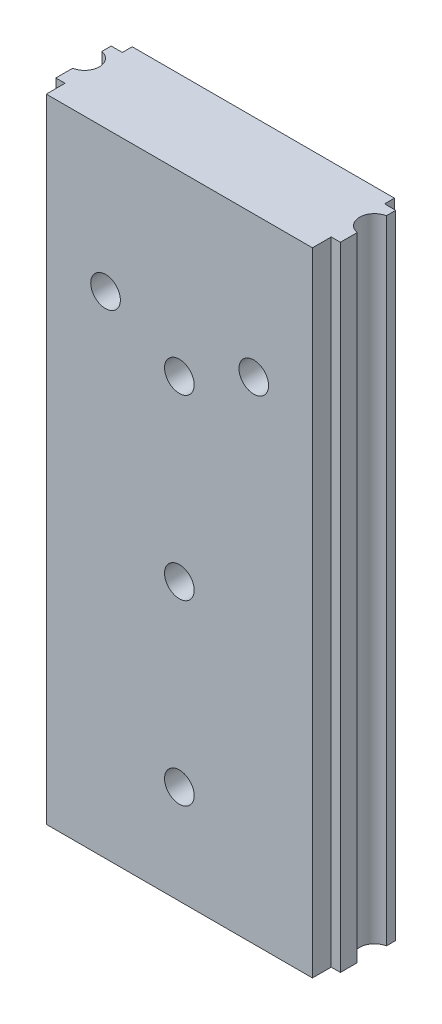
from build123d import *

# Parameters (mm, degrees)
ESQUISSE1_W             = 28.8
ESQUISSE1_H             = 8.5
EXTRUSION1_DEPTH        = 64
ENL_V_MAT_EXTRU_1_DEPTH = 71.694342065
ESQUISSE3_R             = 1.5
ENL_V_MAT_EXTRU_2_DEPTH = 71.694342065
ESQUISSE4_R             = 1.5
ENL_V_MAT_EXTRU_3_DEPTH = 71.694342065


with BuildPart() as part:
    # Esquisse1 → Extrusion1 (new body)
    with BuildSketch(Plane(origin=(0, 0, 0), x_dir=(1, 0, 0), z_dir=(0, 1, 0))):
        with Locations((14.4, 4.25)):
            Rectangle(ESQUISSE1_W, ESQUISSE1_H)
    extrude(amount=EXTRUSION1_DEPTH)

    # Esquisse2 → Enl_v. mat.-Extru.1 (cut, through all)
    with BuildSketch(Plane(origin=(0, 64, 0), x_dir=(-1, 0, 0), z_dir=(0, 1, 0))):
        with BuildLine():
            Line((0, -3.6), (0, -1.9))
            Line((0, -1.9), (-0.93, -1.9))
            Line((-0.93, -1.9), (-0.93, 0))
            Line((-0.93, 0), (1.37, 0))
            Line((1.37, 0), (1.37, -8.5))
            Line((1.37, -8.5), (-1.13, -8.5))
            Line((-1.13, -8.5), (-1.13, -7.5))
            Line((-1.13, -7.5), (0, -7.5))
            Line((0, -7.5), (0, -6.55))
            ThreePointArc((0, -6.55), (-1.227282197, -5.075), (0, -3.6))
        make_face()
        with BuildLine():
            Line((-28.8, -7.5), (-28.8, -6.55))
            ThreePointArc((-28.8, -6.55), (-27.572717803, -5.075), (-28.8, -3.6))
            Line((-28.8, -3.6), (-28.8, -1.9))
            Line((-28.8, -1.9), (-27.87, -1.9))
            Line((-27.87, -1.9), (-27.87, 0))
            Line((-27.87, 0), (-30.17, 0))
            Line((-30.17, 0), (-30.17, -8.5))
            Line((-30.17, -8.5), (-27.67, -8.5))
            Line((-27.67, -8.5), (-27.67, -7.5))
            Line((-27.67, -7.5), (-28.8, -7.5))
        make_face()
    extrude(amount=-ENL_V_MAT_EXTRU_1_DEPTH, mode=Mode.SUBTRACT)

    # Esquisse3 → Enl_v. mat.-Extru.2 (cut, through all)
    with BuildSketch(Plane.XY):
        with Locations((14.4, 10)):
            Circle(ESQUISSE3_R)
        with Locations((14.4, 28)):
            Circle(ESQUISSE3_R)
        with Locations((14.4, 46)):
            Circle(ESQUISSE3_R)
    extrude(amount=-ENL_V_MAT_EXTRU_2_DEPTH, mode=Mode.SUBTRACT)

    # Esquisse4 → Enl_v. mat.-Extru.3 (cut, through all)
    with BuildSketch(Plane(origin=(0, 0, -8.5), x_dir=(-1, 0, 0), z_dir=(0, 0, -1))):
        with Locations((-21.93, 49.700015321)):
            Circle(ESQUISSE4_R)
        with Locations((-6.93, 49.700015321)):
            Circle(ESQUISSE4_R)
    extrude(amount=-ENL_V_MAT_EXTRU_3_DEPTH, mode=Mode.SUBTRACT)


solid = part.part
